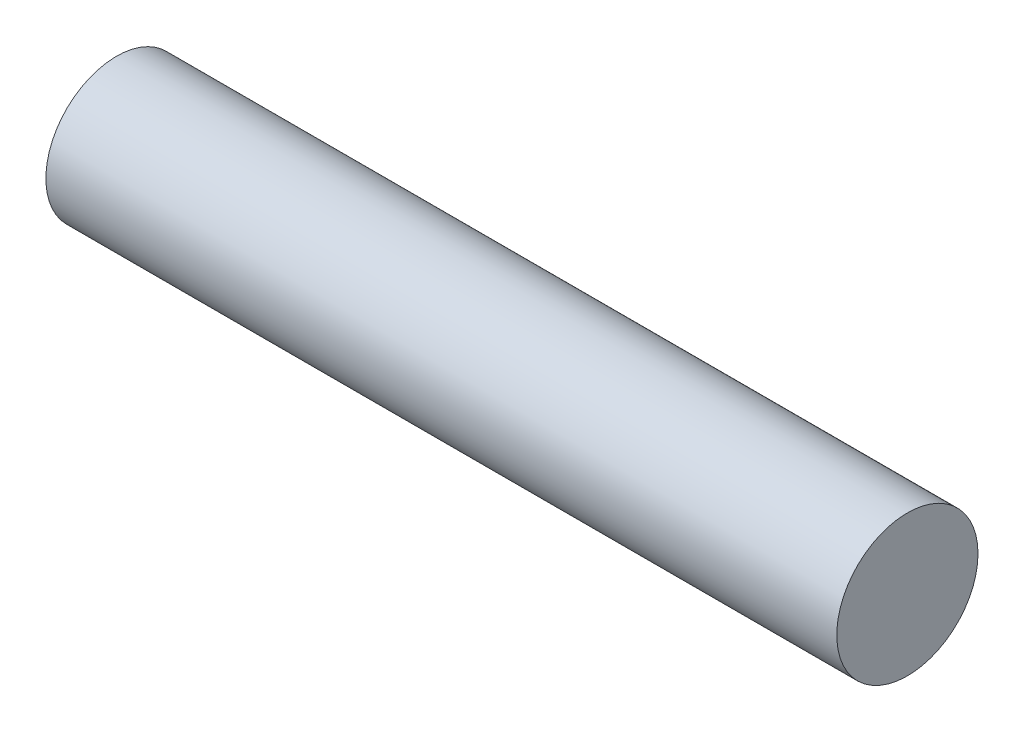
from build123d import *

# Parameters (mm, degrees)
SKIZZE1_R               = 2.5
LINEAR_AUSTRAGEN1_DEPTH = 28


with BuildPart() as part:
    # Skizze1 → Linear austragen1 (new body)
    with BuildSketch(Plane(origin=(0, 0, 0), x_dir=(0, 0, -1), z_dir=(1, 0, 0))):
        Circle(SKIZZE1_R)
    extrude(amount=LINEAR_AUSTRAGEN1_DEPTH)


solid = part.part
